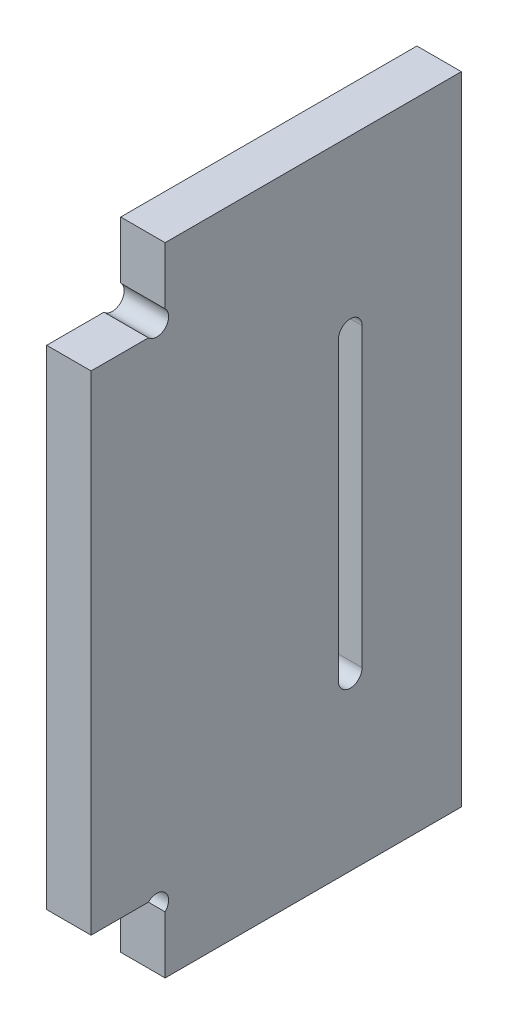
from build123d import *

# Parameters (mm, degrees)
EXTRUSION1_DEPTH        = 6
ENL_V_MAT_EXTRU_1_DEPTH = 2.2


with BuildPart() as part:
    # Esquisse1 → Extrusion1 (new body)
    with BuildSketch(Plane(origin=(0, 0, 0), x_dir=(0, 0, -1), z_dir=(1, 0, 0))):
        with BuildLine():
            Line((120, 249), (80, 249))
            Line((80, 249), (80, 241.2627417))
            ThreePointArc((80, 241.2627417), (80, 239), (77.7372583, 239))
            Line((77.7372583, 239), (70, 239))
            Line((70, 239), (70, 173))
            Line((70, 173), (77.7372583, 173))
            ThreePointArc((77.7372583, 173), (80, 173), (80, 170.7372583))
            Line((80, 170.7372583), (80, 163))
            Line((80, 163), (120, 163))
            Line((120, 163), (120, 249))
        make_face()
        with BuildLine():
            Line((106.6, 226), (106.6, 186))
            ThreePointArc((106.6, 186), (105, 184.4), (103.4, 186))
            Line((103.4, 186), (103.4, 226))
            ThreePointArc((103.4, 226), (105, 227.6), (106.6, 226))
        make_face(mode=Mode.SUBTRACT)
    extrude(amount=EXTRUSION1_DEPTH)

    # Esquisse2 → Enl_v. mat.-Extru.1 (cut)
    with BuildSketch(Plane.ZY):
        with BuildLine():
            Line((-117.55, 245), (-117.55, 167))
            ThreePointArc((-117.55, 167), (-116, 165.45), (-114.45, 167))
            Line((-114.45, 167), (-114.45, 245))
            ThreePointArc((-114.45, 245), (-116, 246.55), (-117.55, 245))
        make_face()
        with BuildLine():
            Line((-95.55, 167), (-95.55, 245))
            ThreePointArc((-95.55, 245), (-94, 246.55), (-92.45, 245))
            Line((-92.45, 245), (-92.45, 167))
            ThreePointArc((-92.45, 167), (-94, 165.45), (-95.55, 167))
        make_face()
    extrude(amount=-ENL_V_MAT_EXTRU_1_DEPTH, mode=Mode.SUBTRACT)


solid = part.part
